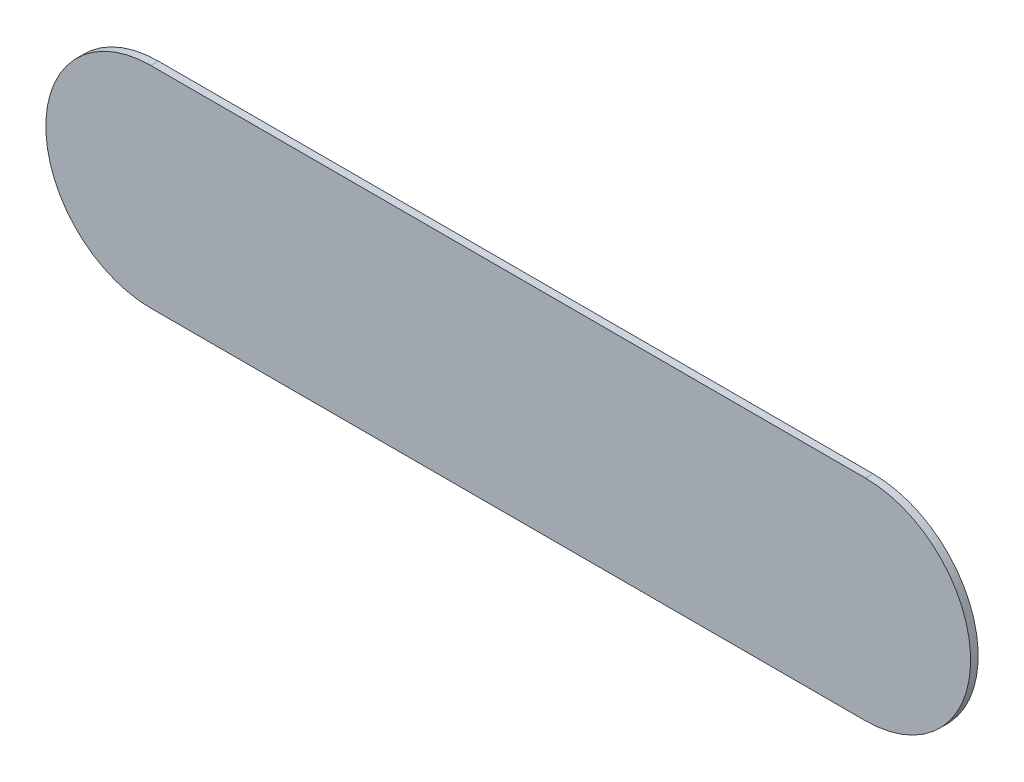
from build123d import *

# Parameters (mm, degrees)
BOSS_EXTRU_1_DEPTH = 18


with BuildPart() as part:
    # Esquisse1 → Boss.-Extru.1 (new body)
    with BuildSketch(Plane.XY):
        with BuildLine():
            Line((-850, -250), (850, -250))
            ThreePointArc((850, -250), (1100, 0), (850, 250))
            Line((850, 250), (-850, 250))
            ThreePointArc((-850, 250), (-1100, 0), (-850, -250))
        make_face()
    extrude(amount=BOSS_EXTRU_1_DEPTH)


solid = part.part
